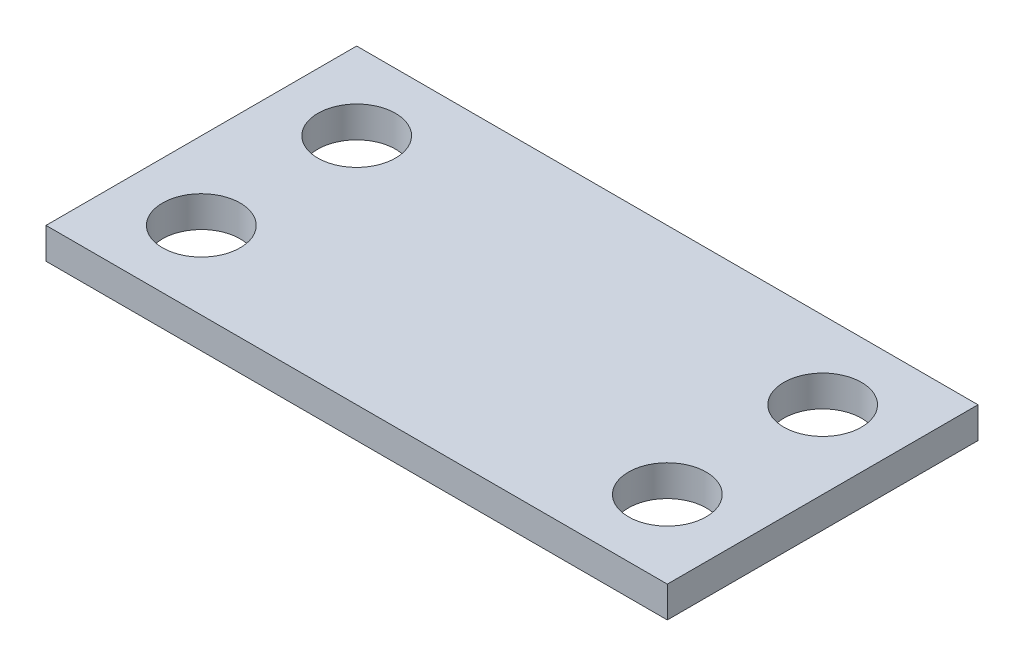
from build123d import *

# Parameters (mm, degrees)
SKETCH1_W           = 80
SKETCH1_H           = 40
BOSS_EXTRUDE1_DEPTH = 4
SKETCH2_R           = 5
CUT_EXTRUDE1_DEPTH  = 45.899888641


with BuildPart() as part:
    # Sketch1 → Boss-Extrude1 (new body)
    with BuildSketch(Plane(origin=(0, 0, 0), x_dir=(1, 0, 0), z_dir=(0, 1, 0))):
        Rectangle(SKETCH1_W, SKETCH1_H)
    extrude(amount=BOSS_EXTRUDE1_DEPTH)

    # Sketch2 → Cut-Extrude1 (cut, through all)
    with BuildSketch(Plane(origin=(0, 4, 0), x_dir=(1, 0, 0), z_dir=(0, 1, 0))):
        with Locations(Location((-30, 10, 0), (0, 0, 270))):
            Circle(SKETCH2_R)
        with Locations(Location((-30, -10, 0), (0, 0, 270))):
            Circle(SKETCH2_R)
        with Locations(Location((30, -10, 0), (0, 0, 270))):
            Circle(SKETCH2_R)
        with Locations(Location((30, 10, 0), (0, 0, 270))):
            Circle(SKETCH2_R)
    extrude(amount=-CUT_EXTRUDE1_DEPTH, mode=Mode.SUBTRACT)


solid = part.part
